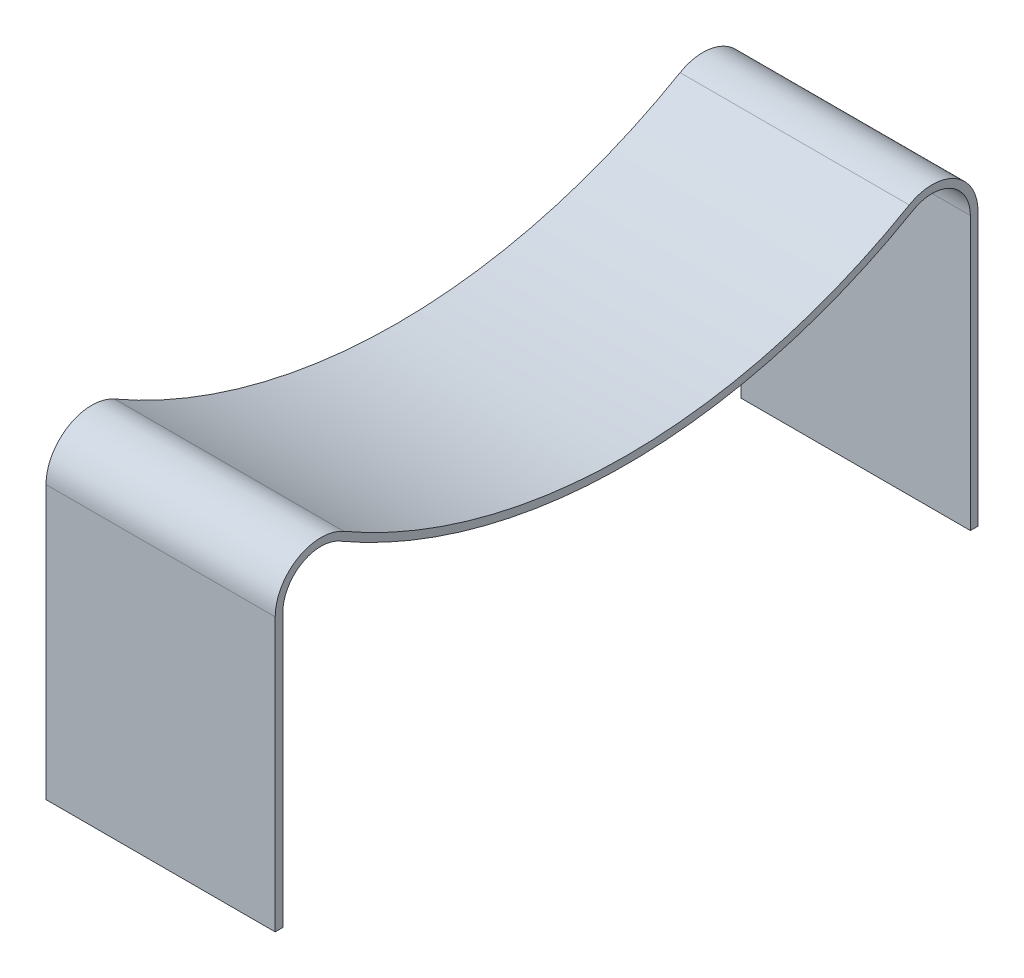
from build123d import *

# Parameters (mm, degrees)
EXTRUSION1_DEPTH      = 3
EXTRUSION1_DEPTH_BACK = 3


with BuildPart() as part:
    # Esquisse1 → Extrusion1 (new, two sides: drawn at the far end of the back side and taken through both)
    with BuildSketch(Plane(origin=(0, 0, 0), x_dir=(0, 0, -1), z_dir=(1, 0, 0)).offset(-EXTRUSION1_DEPTH_BACK)):
        with BuildLine():
            Line((-9, 0), (-9, 7.143593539))
            ThreePointArc((-9, 7.143593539), (-8.5, 8.009618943), (-7.5, 8.009618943))
            ThreePointArc((-7.5, 8.009618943), (0, 6), (7.5, 8.009618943))
            ThreePointArc((7.5, 8.009618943), (8.5, 8.009618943), (9, 7.143593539))
            Line((9, 7.143593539), (9, 0))
            Line((9, 0), (9.2, 0))
            Line((9.2, 0), (9.2, 7.143593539))
            ThreePointArc((9.2, 7.143593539), (8.6, 8.182824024), (7.4, 8.182824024))
            ThreePointArc((7.4, 8.182824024), (0, 6.2), (-7.4, 8.182824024))
            ThreePointArc((-7.4, 8.182824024), (-8.6, 8.182824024), (-9.2, 7.143593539))
            Line((-9.2, 7.143593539), (-9.2, 0))
            Line((-9.2, 0), (-9, 0))
        make_face()
    extrude(amount=EXTRUSION1_DEPTH + EXTRUSION1_DEPTH_BACK)


solid = part.part
